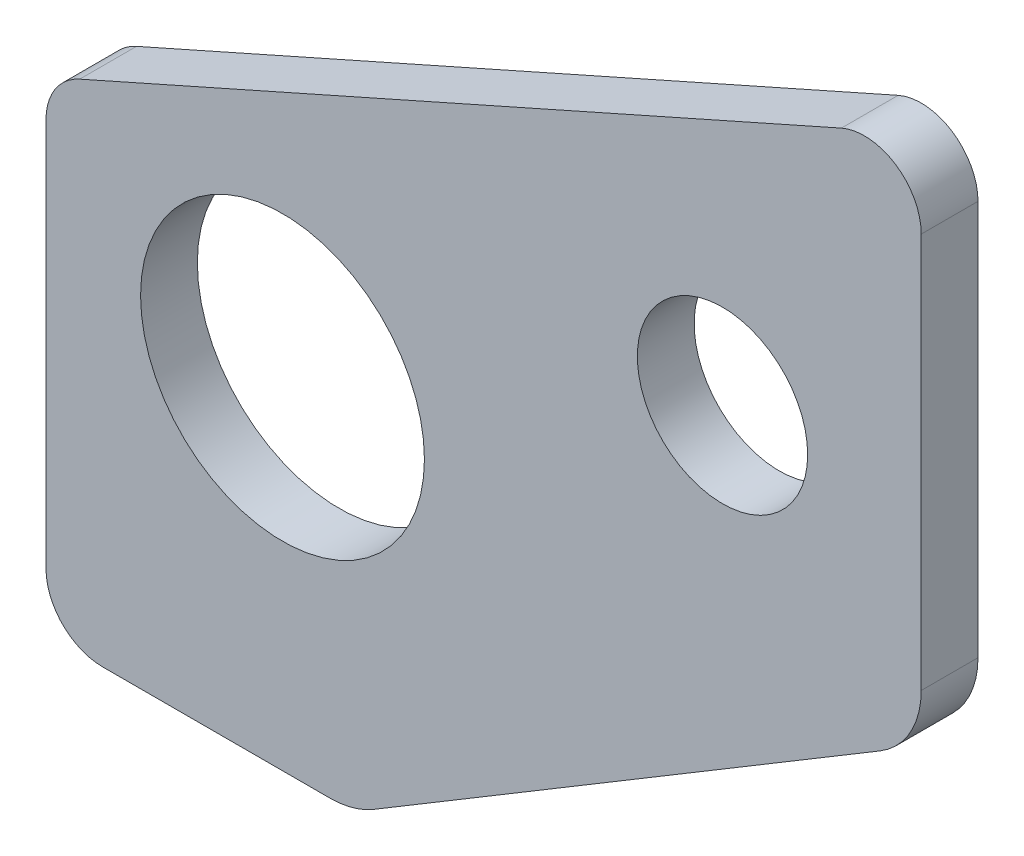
from build123d import *

# Parameters (mm, degrees)
ESQUISSE1_R      = 5
ESQUISSE1_R_2    = 3
EXTRUSION1_DEPTH = 2


with BuildPart() as part:
    # Esquisse1 → Extrusion1 (new body)
    with BuildSketch(Plane.XY):
        with BuildLine():
            Line((-2.902708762, 31.676519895), (14.928243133, 42.375091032))
            ThreePointArc((14.928243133, 42.375091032), (15.995355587, 43.469473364), (16.384755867, 44.947569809))
            Line((16.384755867, 44.947569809), (16.384755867, 58.870417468))
            ThreePointArc((16.384755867, 58.870417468), (15.474675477, 60.547341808), (13.572680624, 60.698130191))
            Line((13.572680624, 60.698130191), (-13.258271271, 48.776808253))
            ThreePointArc((-13.258271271, 48.776808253), (-14.123120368, 48.03901514), (-14.446196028, 46.949095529))
            Line((-14.446196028, 46.949095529), (-14.446196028, 33.248998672))
            ThreePointArc((-14.446196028, 33.248998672), (-13.86040959, 31.83478511), (-12.446196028, 31.248998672))
            Line((-12.446196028, 31.248998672), (-4.446196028, 31.248998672))
            ThreePointArc((-4.446196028, 31.248998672), (-3.645395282, 31.357853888), (-2.902708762, 31.676519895))
        make_face()
        with Locations((-6.115244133, 43.248998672)):
            Circle(ESQUISSE1_R, mode=Mode.SUBTRACT)
        with Locations((9.384755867, 50.143722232)):
            Circle(ESQUISSE1_R_2, mode=Mode.SUBTRACT)
    extrude(amount=-EXTRUSION1_DEPTH)


solid = part.part
